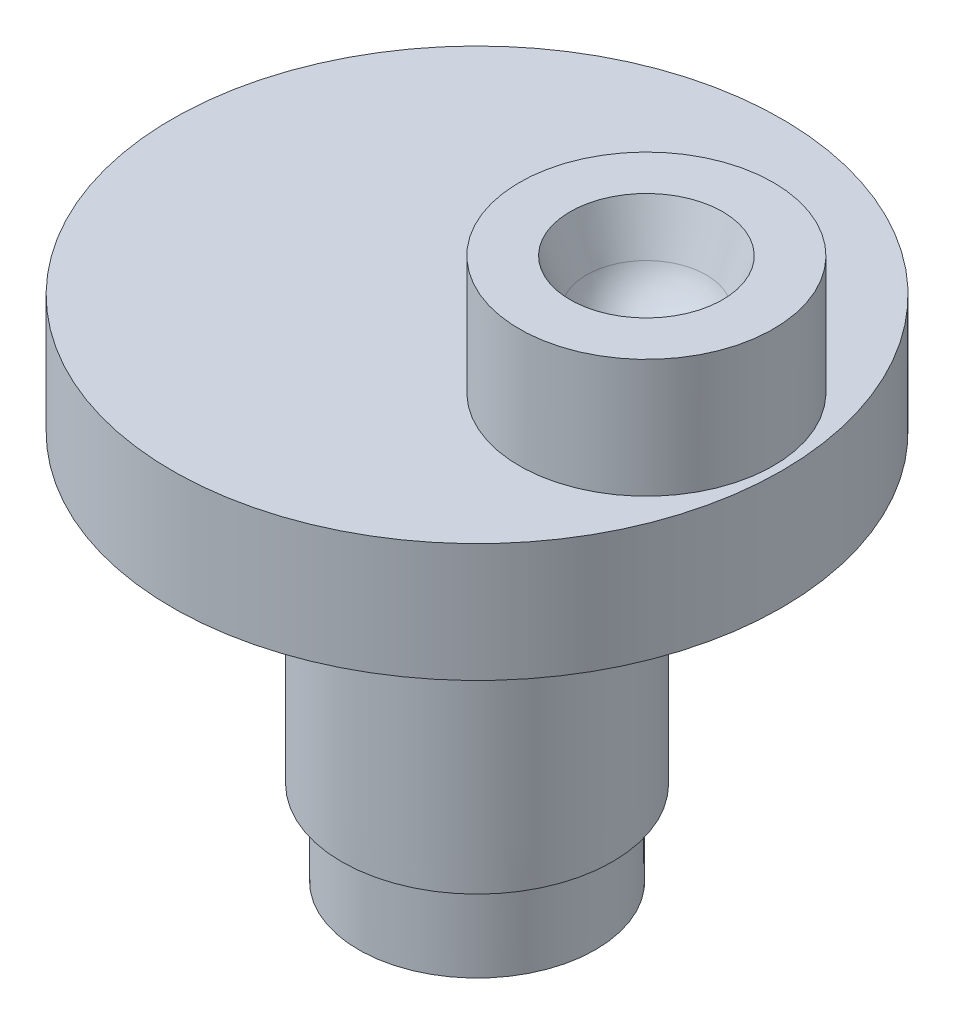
from build123d import *


with BuildPart() as part:
    # Esquisse1 → R_volution3 (revolve)
    with BuildSketch(Plane.XY):
        Polygon((0, 0), (36.000026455, 0), (36.0000215, -14), (29.000080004, -14), (28.762875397, -13), (15, -13), (15, -17), (16.000086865, -17), (16.000065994, -50), (14.00007731, -50), (14.000056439, -60), (0, -60), align=None)
    revolve(axis=Axis((0, -60, 0), (0, 1, 0)))

    # Esquisse3 → R_volution4 (revolve)
    with BuildSketch(Plane.XY, mode=Mode.PRIVATE) as r_volution4_sk:
        with BuildLine():
            Line((20, 0), (35.000082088, 0))
            Line((35.000082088, 0), (35.000082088, 14))
            Line((35.000082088, 14), (29.010502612, 14))
            Line((29.010502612, 14), (27.073131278, 8.505844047))
            ThreePointArc((27.073131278, 8.505844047), (24.332656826, 4.878065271), (20, 3.5))
            Line((20, 3.5), (20, 0))
        make_face()
    revolve(r_volution4_sk.sketch.rotate(Axis((20, 0, 0), (0, 1, 0)), 90), axis=Axis((20, 0, 0), (0, 1, 0)))


solid = part.part
